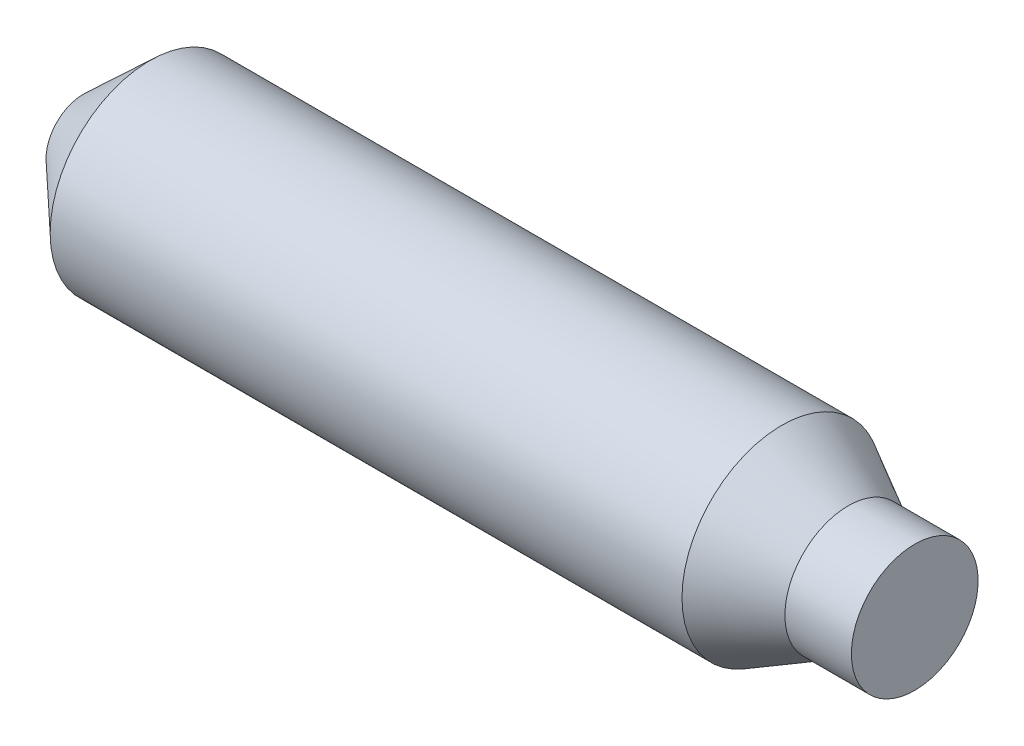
ISO-10303-21;
HEADER;
FILE_DESCRIPTION(('STEP AP214'),'2;1');
FILE_NAME('part.step','',(''),(''),'','','');
FILE_SCHEMA(('AUTOMOTIVE_DESIGN { 1 0 10303 214 1 1 1 1 }'));
ENDSEC;
DATA;
#1=APPLICATION_CONTEXT('core data for automotive mechanical design processes');
#2=APPLICATION_PROTOCOL_DEFINITION('international standard','automotive_design',2000,#1);
#3=PRODUCT_CONTEXT('',#1,'mechanical');
#4=PRODUCT('Part','Part','',(#3));
#5=PRODUCT_RELATED_PRODUCT_CATEGORY('part','',(#4));
#6=PRODUCT_DEFINITION_FORMATION('','',#4);
#7=PRODUCT_DEFINITION_CONTEXT('part definition',#1,'design');
#8=PRODUCT_DEFINITION('design','',#6,#7);
#9=PRODUCT_DEFINITION_SHAPE('','',#8);
#10=(LENGTH_UNIT() NAMED_UNIT(*) SI_UNIT(.MILLI.,.METRE.));
#11=(NAMED_UNIT(*) PLANE_ANGLE_UNIT() SI_UNIT($,.RADIAN.));
#12=(NAMED_UNIT(*) SI_UNIT($,.STERADIAN.) SOLID_ANGLE_UNIT());
#13=UNCERTAINTY_MEASURE_WITH_UNIT(LENGTH_MEASURE(1.E-05),#10,'distance_accuracy_value','');
#14=(GEOMETRIC_REPRESENTATION_CONTEXT(3) GLOBAL_UNCERTAINTY_ASSIGNED_CONTEXT((#13)) GLOBAL_UNIT_ASSIGNED_CONTEXT((#10,
#11,#12)) REPRESENTATION_CONTEXT('',''));
#15=CARTESIAN_POINT('',(0.,0.,0.));
#16=DIRECTION('',(0.,0.,1.));
#17=DIRECTION('',(1.,0.,0.));
#18=AXIS2_PLACEMENT_3D('',#15,#16,#17);
#19=CARTESIAN_POINT('',(0.,0.,0.));
#20=DIRECTION('',(1.,0.,0.));
#21=DIRECTION('',(0.,0.,-1.));
#22=AXIS2_PLACEMENT_3D('',#19,#20,#21);
#23=PLANE('',#22);
#24=CARTESIAN_POINT('',(0.,0.,0.));
#25=DIRECTION('',(-1.,0.,0.));
#26=DIRECTION('',(0.,0.,1.));
#27=AXIS2_PLACEMENT_3D('',#24,#25,#26);
#28=CIRCLE('',#27,22.5);
#29=CARTESIAN_POINT('',(0.,0.,22.5));
#30=VERTEX_POINT('',#29);
#31=EDGE_CURVE('E10',#30,#30,#28,.T.);
#32=ORIENTED_EDGE('',*,*,#31,.T.);
#33=EDGE_LOOP('',(#32));
#34=FACE_BOUND('',#33,.T.);
#35=ADVANCED_FACE('F30',(#34),#23,.F.);
#36=CARTESIAN_POINT('',(40.,0.,0.));
#37=DIRECTION('',(1.,0.,0.));
#38=DIRECTION('',(0.,0.,-1.));
#39=AXIS2_PLACEMENT_3D('',#36,#37,#38);
#40=CONICAL_SURFACE('',#39,59.9999999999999,0.753151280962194);
#41=ORIENTED_EDGE('',*,*,#31,.F.);
#42=EDGE_LOOP('',(#41));
#43=FACE_BOUND('',#42,.T.);
#44=CARTESIAN_POINT('',(40.,0.,0.));
#45=DIRECTION('',(-1.,0.,0.));
#46=DIRECTION('',(0.,0.,1.));
#47=AXIS2_PLACEMENT_3D('',#44,#45,#46);
#48=CIRCLE('',#47,59.9999999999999);
#49=CARTESIAN_POINT('',(40.,0.,59.9999999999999));
#50=VERTEX_POINT('',#49);
#51=EDGE_CURVE('E36',#50,#50,#48,.T.);
#52=ORIENTED_EDGE('',*,*,#51,.T.);
#53=EDGE_LOOP('',(#52));
#54=FACE_BOUND('',#53,.T.);
#55=ADVANCED_FACE('F65',(#43,#54),#40,.T.);
#56=CARTESIAN_POINT('',(0.,0.,0.));
#57=DIRECTION('',(-1.,0.,0.));
#58=DIRECTION('',(0.,0.,1.));
#59=AXIS2_PLACEMENT_3D('',#56,#57,#58);
#60=CYLINDRICAL_SURFACE('',#59,59.9999999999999);
#61=ORIENTED_EDGE('',*,*,#51,.F.);
#62=EDGE_LOOP('',(#61));
#63=FACE_BOUND('',#62,.T.);
#64=CARTESIAN_POINT('',(420.,0.,0.));
#65=DIRECTION('',(-1.,0.,0.));
#66=DIRECTION('',(0.,0.,1.));
#67=AXIS2_PLACEMENT_3D('',#64,#65,#66);
#68=CIRCLE('',#67,59.9999999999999);
#69=CARTESIAN_POINT('',(420.,0.,59.9999999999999));
#70=VERTEX_POINT('',#69);
#71=EDGE_CURVE('E40',#70,#70,#68,.T.);
#72=ORIENTED_EDGE('',*,*,#71,.T.);
#73=EDGE_LOOP('',(#72));
#74=FACE_BOUND('',#73,.T.);
#75=ADVANCED_FACE('F69',(#63,#74),#60,.T.);
#76=CARTESIAN_POINT('',(460.,0.,0.));
#77=DIRECTION('',(-1.,0.,0.));
#78=DIRECTION('',(0.,0.,1.));
#79=AXIS2_PLACEMENT_3D('',#76,#77,#78);
#80=CONICAL_SURFACE('',#79,38.110119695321,0.500727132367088);
#81=ORIENTED_EDGE('',*,*,#71,.F.);
#82=EDGE_LOOP('',(#81));
#83=FACE_BOUND('',#82,.T.);
#84=CARTESIAN_POINT('',(460.,0.,0.));
#85=DIRECTION('',(-1.,0.,0.));
#86=DIRECTION('',(0.,0.,1.));
#87=AXIS2_PLACEMENT_3D('',#84,#85,#86);
#88=CIRCLE('',#87,38.110119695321);
#89=CARTESIAN_POINT('',(460.,0.,38.110119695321));
#90=VERTEX_POINT('',#89);
#91=EDGE_CURVE('E44',#90,#90,#88,.T.);
#92=ORIENTED_EDGE('',*,*,#91,.T.);
#93=EDGE_LOOP('',(#92));
#94=FACE_BOUND('',#93,.T.);
#95=ADVANCED_FACE('F61',(#83,#94),#80,.T.);
#96=CARTESIAN_POINT('',(0.,0.,0.));
#97=DIRECTION('',(-1.,0.,0.));
#98=DIRECTION('',(0.,0.,1.));
#99=AXIS2_PLACEMENT_3D('',#96,#97,#98);
#100=CYLINDRICAL_SURFACE('',#99,38.110119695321);
#101=ORIENTED_EDGE('',*,*,#91,.F.);
#102=EDGE_LOOP('',(#101));
#103=FACE_BOUND('',#102,.T.);
#104=CARTESIAN_POINT('',(500.,0.,0.));
#105=DIRECTION('',(-1.,0.,0.));
#106=DIRECTION('',(0.,0.,1.));
#107=AXIS2_PLACEMENT_3D('',#104,#105,#106);
#108=CIRCLE('',#107,38.110119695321);
#109=CARTESIAN_POINT('',(500.,0.,38.110119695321));
#110=VERTEX_POINT('',#109);
#111=EDGE_CURVE('E49',#110,#110,#108,.T.);
#112=ORIENTED_EDGE('',*,*,#111,.T.);
#113=EDGE_LOOP('',(#112));
#114=FACE_BOUND('',#113,.T.);
#115=ADVANCED_FACE('F53',(#103,#114),#100,.T.);
#116=CARTESIAN_POINT('',(500.,38.110119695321,0.));
#117=DIRECTION('',(-1.,0.,0.));
#118=DIRECTION('',(0.,0.,1.));
#119=AXIS2_PLACEMENT_3D('',#116,#117,#118);
#120=PLANE('',#119);
#121=ORIENTED_EDGE('',*,*,#111,.F.);
#122=EDGE_LOOP('',(#121));
#123=FACE_BOUND('',#122,.T.);
#124=ADVANCED_FACE('F55',(#123),#120,.F.);
#125=CLOSED_SHELL('',(#35,#55,#75,#95,#115,#124));
#126=MANIFOLD_SOLID_BREP('B2',#125);
#127=ADVANCED_BREP_SHAPE_REPRESENTATION('',(#18,#126),#14);
#128=SHAPE_DEFINITION_REPRESENTATION(#9,#127);
ENDSEC;
END-ISO-10303-21;
